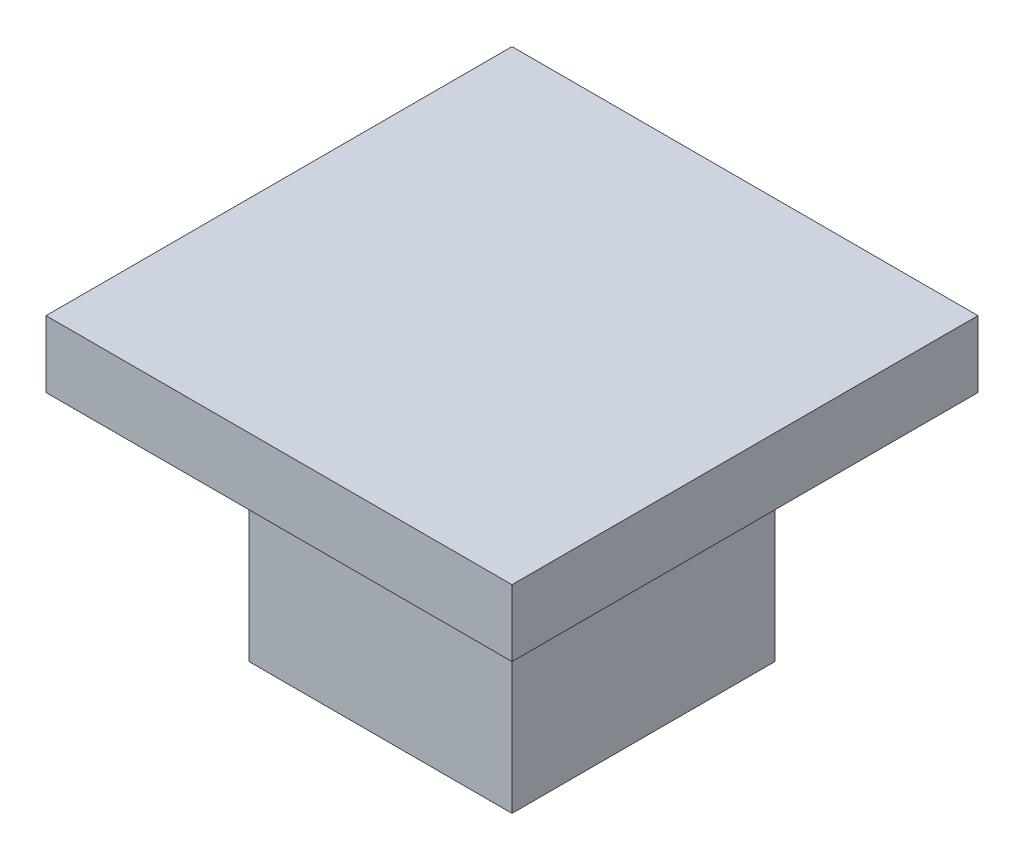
from build123d import *

# Parameters (mm, degrees)
ESQUISSE1_W        = 7.9
ESQUISSE1_H        = 7.9
BOSS_EXTRU_1_DEPTH = 7
ESQUISSE4_W        = 14
ESQUISSE4_H        = 14
BOSS_EXTRU_2_DEPTH = 2


with BuildPart() as part:
    # Esquisse1 → Boss.-Extru.1 (new body)
    with BuildSketch(Plane(origin=(0, 0, 0), x_dir=(1, 0, 0), z_dir=(0, 1, 0))):
        Rectangle(ESQUISSE1_W, ESQUISSE1_H)
    extrude(amount=BOSS_EXTRU_1_DEPTH)

    # Esquisse4 → Boss.-Extru.2 (add)
    with BuildSketch(Plane(origin=(0, 7, 0), x_dir=(1, 0, 0), z_dir=(0, 1, 0))):
        Rectangle(ESQUISSE4_W, ESQUISSE4_H)
    extrude(amount=BOSS_EXTRU_2_DEPTH)


solid = part.part
